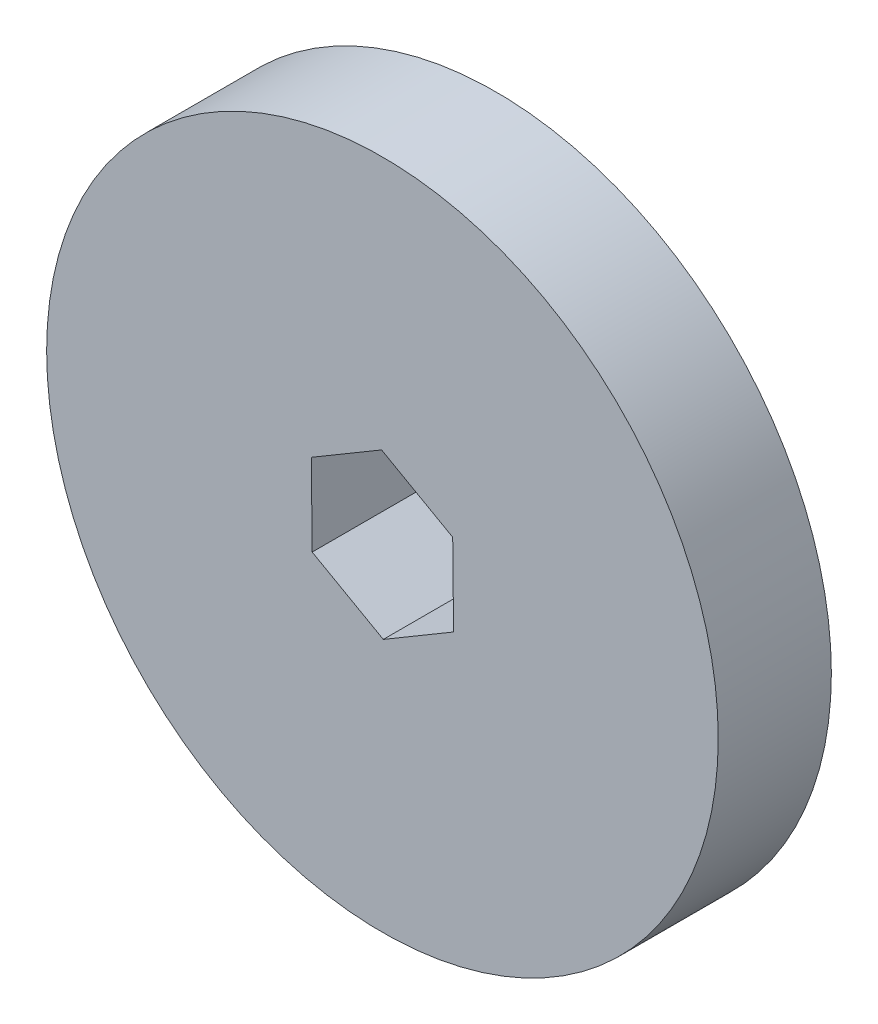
from build123d import *

# Parameters (mm, degrees)
SKETCH3_R           = 30.1625
BOSS_EXTRUDE2_DEPTH = 10.16
CUT_EXTRUDE1_DEPTH  = 10.16


with BuildPart() as part:
    # Sketch3 → Boss-Extrude2 (new body)
    with BuildSketch(Plane.XY):
        Circle(SKETCH3_R)
    extrude(amount=BOSS_EXTRUDE2_DEPTH)

    # Sketch5 → Cut-Extrude1 (cut)
    with BuildSketch(Plane.XY.offset(10.16)):
        Polygon((6.310970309, 3.732959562), (-0.077352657, 7.331940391), (-6.388322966, 3.598980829), (-6.310970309, -3.732959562), (0.077352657, -7.331940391), (6.388322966, -3.598980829), align=None)
    extrude(amount=-CUT_EXTRUDE1_DEPTH, mode=Mode.SUBTRACT)


solid = part.part
